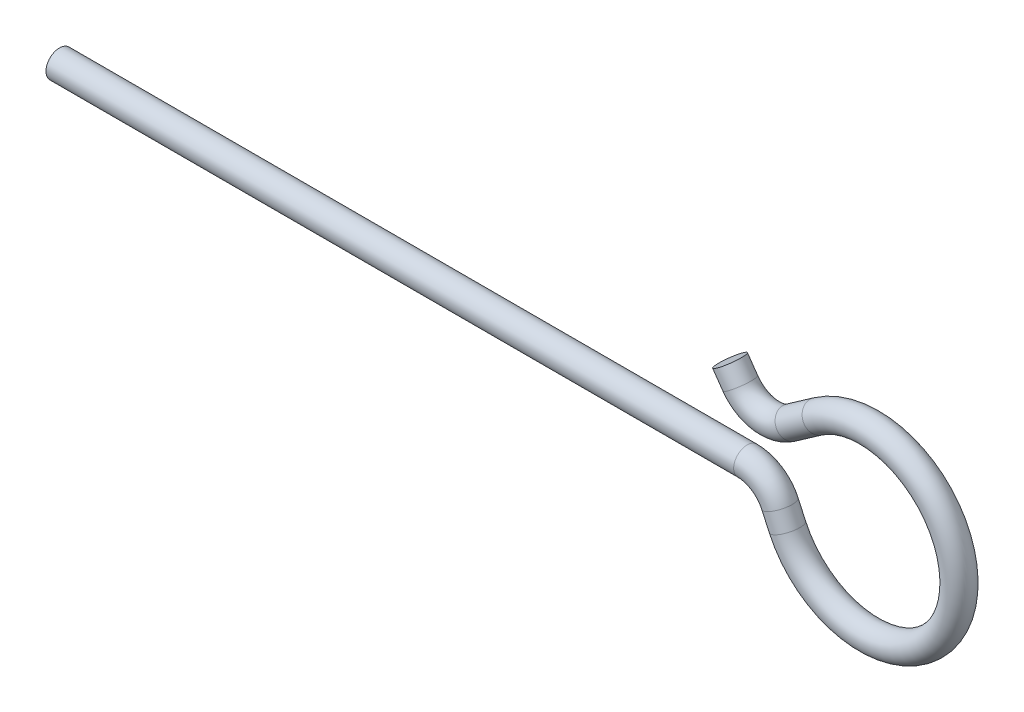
from build123d import *

# Parameters (mm, degrees)
ESQUISSE2_R = 0.75


with BuildPart() as part:
    # Balayage1: sweep along a path in Esquisse1
    with BuildLine(Plane.XY) as balayage1_path:
        Line((0, 0), (38.217670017, 0))
        ThreePointArc((38.217670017, 0), (39.298737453, -0.317355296), (40.036722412, -1.168706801))
        Line((40.036722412, -1.168706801), (40.452369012, -2.078232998))
        ThreePointArc((40.452369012, -2.078232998), (49.824656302, -1.312513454), (42.131922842, 4.095623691))
        Line((42.131922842, 4.095623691), (40.631922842, 3.045205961))
        ThreePointArc((40.631922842, 3.045205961), (39.137489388, 2.7138234), (37.846442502, 3.536224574))
        Line((37.846442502, 3.536224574), (37.272827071, 4.355349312))
    # Esquisse2 → Balayage1 (sweep)
    with BuildSketch(Plane(origin=(0, 0, 0), x_dir=(0, 0, -1), z_dir=(1, 0, 0))):
        with Locations((0.005144, 0.008264)):
            Circle(ESQUISSE2_R)
    sweep(path=balayage1_path.line)


solid = part.part
